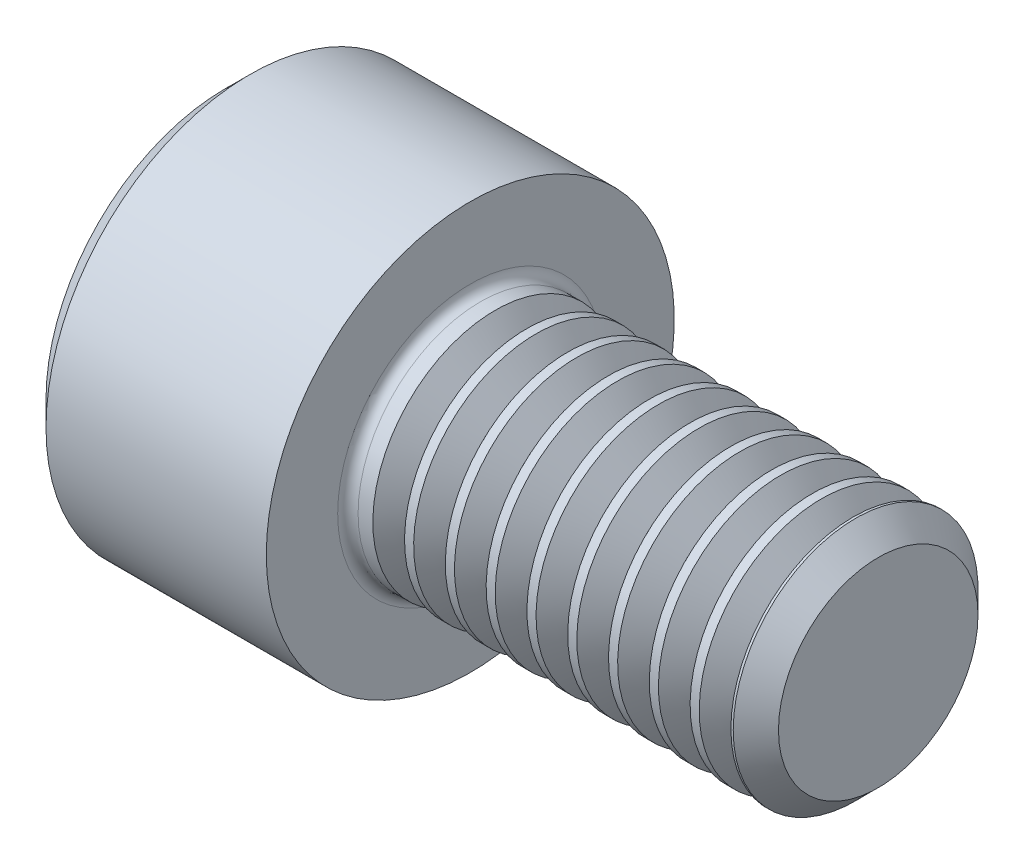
from build123d import *

# Parameters (mm, degrees)
FILLET1_R       = 0.25
HEX_2_DEPTH     = 3
THDSCHPAT_COUNT = 9
THDSCHPAT_PITCH = 1


with BuildPart() as part:
    # BodySke → Base-Revolve (revolve)
    with BuildSketch(Plane.XY, mode=Mode.PRIVATE) as base_revolve_sk:
        Polygon((0, 0), (0, 4.4), (0.6, 5), (6, 5), (6, 3), (15.4455, 3), (16, 2.4455), (16, 0), align=None)
    revolve(base_revolve_sk.sketch.rotate(Axis((-31.75, 0, 0), (1, 0, 0)), 90), axis=Axis((-31.75, 0, 0), (1, 0, 0)))

    # Fillet1
    fillet1_edges = [part.edges().sort_by_distance(p)[0] for p in [
        (6, 0, -3),
    ]]
    fillet(fillet1_edges, radius=FILLET1_R)

    # Sketch2 → Hex-PreBroach (revolve, cut)
    with BuildSketch(Plane.XY, mode=Mode.PRIVATE) as hex_prebroach_sk:
        Polygon((0, 2.542), (3, 2.542), (4.467624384, 0), (0, 0), align=None)
    revolve(hex_prebroach_sk.sketch.rotate(Axis((0, 0, 0), (1, 0, 0)), 90), axis=Axis((0, 0, 0), (1, 0, 0)), mode=Mode.SUBTRACT)

    # Sketch3 → Hex 2 (cut)
    with BuildSketch(Plane(origin=(0, 0, 0), x_dir=(0, 0.500000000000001, 0.866025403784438), z_dir=(-1, 0, 0))):
        Polygon((1.467624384, 2.542), (-1.467624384, 2.542), (-2.935248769, 0), (-1.467624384, -2.542), (1.467624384, -2.542), (2.935248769, 0), align=None)
    extrude(amount=-HEX_2_DEPTH, mode=Mode.SUBTRACT)

    # ThdSchSke → ThreadSchematic (revolve, cut)
    with BuildSketch(Plane.XY):
        Polygon((7, -2.4455), (6.61173492, -3), (6.61173492, -3.75), (7.38826508, -3.75), (7.38826508, -3), align=None)
    threadschematic = revolve(axis=Axis((-3.175, 0, 0), (1, 0, 0)), mode=Mode.SUBTRACT)

    # ThdSchPat: ThreadSchematic ×9
    with Locations(*[(i * THDSCHPAT_PITCH, 0, 0) for i in range(1, THDSCHPAT_COUNT)]):
        add(threadschematic, mode=Mode.SUBTRACT)


solid = part.part
